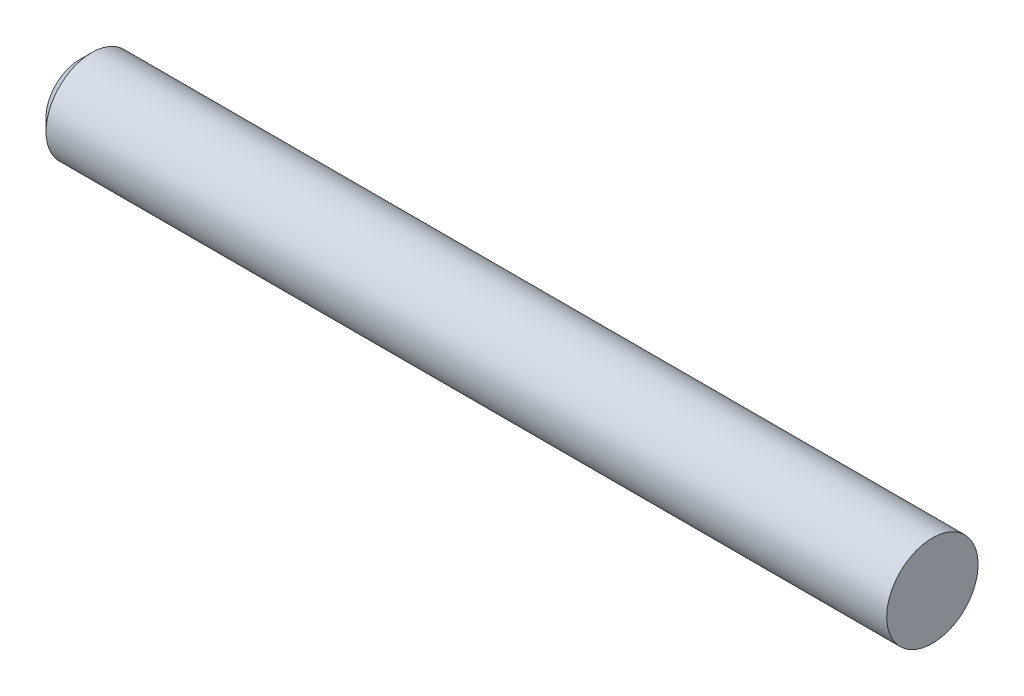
ISO-10303-21;
HEADER;
FILE_DESCRIPTION(('STEP AP214'),'2;1');
FILE_NAME('part.step','',(''),(''),'','','');
FILE_SCHEMA(('AUTOMOTIVE_DESIGN { 1 0 10303 214 1 1 1 1 }'));
ENDSEC;
DATA;
#1=APPLICATION_CONTEXT('core data for automotive mechanical design processes');
#2=APPLICATION_PROTOCOL_DEFINITION('international standard','automotive_design',2000,#1);
#3=PRODUCT_CONTEXT('',#1,'mechanical');
#4=PRODUCT('Part','Part','',(#3));
#5=PRODUCT_RELATED_PRODUCT_CATEGORY('part','',(#4));
#6=PRODUCT_DEFINITION_FORMATION('','',#4);
#7=PRODUCT_DEFINITION_CONTEXT('part definition',#1,'design');
#8=PRODUCT_DEFINITION('design','',#6,#7);
#9=PRODUCT_DEFINITION_SHAPE('','',#8);
#10=(LENGTH_UNIT() NAMED_UNIT(*) SI_UNIT(.MILLI.,.METRE.));
#11=(NAMED_UNIT(*) PLANE_ANGLE_UNIT() SI_UNIT($,.RADIAN.));
#12=(NAMED_UNIT(*) SI_UNIT($,.STERADIAN.) SOLID_ANGLE_UNIT());
#13=UNCERTAINTY_MEASURE_WITH_UNIT(LENGTH_MEASURE(1.E-05),#10,'distance_accuracy_value','');
#14=(GEOMETRIC_REPRESENTATION_CONTEXT(3) GLOBAL_UNCERTAINTY_ASSIGNED_CONTEXT((#13)) GLOBAL_UNIT_ASSIGNED_CONTEXT((#10,
#11,#12)) REPRESENTATION_CONTEXT('',''));
#15=CARTESIAN_POINT('',(0.,0.,0.));
#16=DIRECTION('',(0.,0.,1.));
#17=DIRECTION('',(1.,0.,0.));
#18=AXIS2_PLACEMENT_3D('',#15,#16,#17);
#19=CARTESIAN_POINT('',(0.,0.,0.));
#20=DIRECTION('',(1.,0.,0.));
#21=DIRECTION('',(0.,0.,-1.));
#22=AXIS2_PLACEMENT_3D('',#19,#20,#21);
#23=PLANE('',#22);
#24=CARTESIAN_POINT('',(0.,0.,0.));
#25=DIRECTION('',(1.,0.,0.));
#26=DIRECTION('',(0.,0.,-1.));
#27=AXIS2_PLACEMENT_3D('',#24,#25,#26);
#28=CIRCLE('',#27,13.97);
#29=CARTESIAN_POINT('',(0.,0.,-13.97));
#30=VERTEX_POINT('',#29);
#31=EDGE_CURVE('E36',#30,#30,#28,.F.);
#32=ORIENTED_EDGE('',*,*,#31,.T.);
#33=EDGE_LOOP('',(#32));
#34=FACE_BOUND('',#33,.T.);
#35=ADVANCED_FACE('F29',(#34),#23,.F.);
#36=CARTESIAN_POINT('',(0.,0.,0.));
#37=DIRECTION('',(-1.,0.,0.));
#38=DIRECTION('',(0.,0.,1.));
#39=AXIS2_PLACEMENT_3D('',#36,#37,#38);
#40=CYLINDRICAL_SURFACE('',#39,19.05);
#41=CARTESIAN_POINT('',(5.08000000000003,0.,0.));
#42=DIRECTION('',(1.,0.,0.));
#43=DIRECTION('',(0.,0.,-1.));
#44=AXIS2_PLACEMENT_3D('',#41,#42,#43);
#45=CIRCLE('',#44,19.05);
#46=CARTESIAN_POINT('',(5.08000000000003,0.,-19.05));
#47=VERTEX_POINT('',#46);
#48=EDGE_CURVE('E10',#47,#47,#45,.T.);
#49=ORIENTED_EDGE('',*,*,#48,.T.);
#50=EDGE_LOOP('',(#49));
#51=FACE_BOUND('',#50,.T.);
#52=CARTESIAN_POINT('',(355.6,0.,0.));
#53=DIRECTION('',(-1.,0.,0.));
#54=DIRECTION('',(0.,0.,1.));
#55=AXIS2_PLACEMENT_3D('',#52,#53,#54);
#56=CIRCLE('',#55,19.05);
#57=CARTESIAN_POINT('',(355.6,0.,19.05));
#58=VERTEX_POINT('',#57);
#59=EDGE_CURVE('E40',#58,#58,#56,.T.);
#60=ORIENTED_EDGE('',*,*,#59,.T.);
#61=EDGE_LOOP('',(#60));
#62=FACE_BOUND('',#61,.T.);
#63=ADVANCED_FACE('F47',(#51,#62),#40,.T.);
#64=CARTESIAN_POINT('',(355.6,0.,0.));
#65=DIRECTION('',(-1.,0.,0.));
#66=DIRECTION('',(0.,0.,1.));
#67=AXIS2_PLACEMENT_3D('',#64,#65,#66);
#68=PLANE('',#67);
#69=ORIENTED_EDGE('',*,*,#59,.F.);
#70=EDGE_LOOP('',(#69));
#71=FACE_BOUND('',#70,.T.);
#72=ADVANCED_FACE('F49',(#71),#68,.F.);
#73=CARTESIAN_POINT('',(0.,0.,0.));
#74=DIRECTION('',(1.,0.,0.));
#75=DIRECTION('',(0.,0.,-1.));
#76=AXIS2_PLACEMENT_3D('',#73,#74,#75);
#77=CONICAL_SURFACE('',#76,13.97,0.785398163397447);
#78=ORIENTED_EDGE('',*,*,#48,.F.);
#79=EDGE_LOOP('',(#78));
#80=FACE_BOUND('',#79,.T.);
#81=ORIENTED_EDGE('',*,*,#31,.F.);
#82=EDGE_LOOP('',(#81));
#83=FACE_BOUND('',#82,.T.);
#84=ADVANCED_FACE('F31',(#80,#83),#77,.T.);
#85=CLOSED_SHELL('',(#35,#63,#72,#84));
#86=MANIFOLD_SOLID_BREP('B2',#85);
#87=ADVANCED_BREP_SHAPE_REPRESENTATION('',(#18,#86),#14);
#88=SHAPE_DEFINITION_REPRESENTATION(#9,#87);
ENDSEC;
END-ISO-10303-21;
